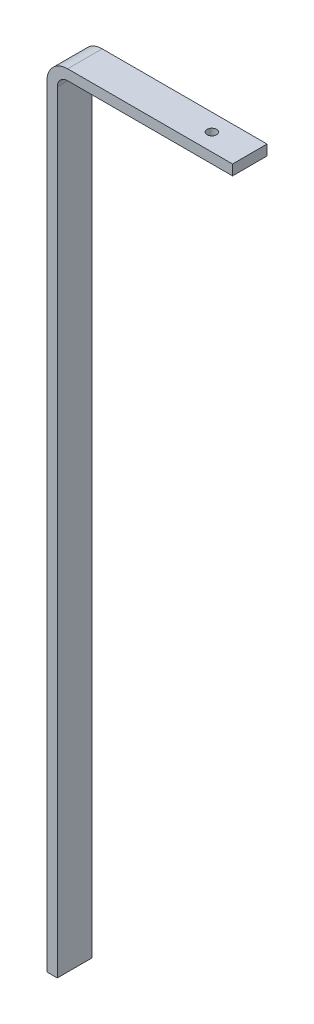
ISO-10303-21;
HEADER;
FILE_DESCRIPTION(('STEP AP214'),'2;1');
FILE_NAME('part.step','',(''),(''),'','','');
FILE_SCHEMA(('AUTOMOTIVE_DESIGN { 1 0 10303 214 1 1 1 1 }'));
ENDSEC;
DATA;
#1=APPLICATION_CONTEXT('core data for automotive mechanical design processes');
#2=APPLICATION_PROTOCOL_DEFINITION('international standard','automotive_design',2000,#1);
#3=PRODUCT_CONTEXT('',#1,'mechanical');
#4=PRODUCT('Part','Part','',(#3));
#5=PRODUCT_RELATED_PRODUCT_CATEGORY('part','',(#4));
#6=PRODUCT_DEFINITION_FORMATION('','',#4);
#7=PRODUCT_DEFINITION_CONTEXT('part definition',#1,'design');
#8=PRODUCT_DEFINITION('design','',#6,#7);
#9=PRODUCT_DEFINITION_SHAPE('','',#8);
#10=(LENGTH_UNIT() NAMED_UNIT(*) SI_UNIT(.MILLI.,.METRE.));
#11=(NAMED_UNIT(*) PLANE_ANGLE_UNIT() SI_UNIT($,.RADIAN.));
#12=(NAMED_UNIT(*) SI_UNIT($,.STERADIAN.) SOLID_ANGLE_UNIT());
#13=UNCERTAINTY_MEASURE_WITH_UNIT(LENGTH_MEASURE(1.E-05),#10,'distance_accuracy_value','');
#14=(GEOMETRIC_REPRESENTATION_CONTEXT(3) GLOBAL_UNCERTAINTY_ASSIGNED_CONTEXT((#13)) GLOBAL_UNIT_ASSIGNED_CONTEXT((#10,
#11,#12)) REPRESENTATION_CONTEXT('',''));
#15=CARTESIAN_POINT('',(0.,0.,0.));
#16=DIRECTION('',(0.,0.,1.));
#17=DIRECTION('',(1.,0.,0.));
#18=AXIS2_PLACEMENT_3D('',#15,#16,#17);
#19=CARTESIAN_POINT('',(95.5,12.,20.));
#20=DIRECTION('',(-1.,0.,0.));
#21=DIRECTION('',(0.,0.,1.));
#22=AXIS2_PLACEMENT_3D('',#19,#20,#21);
#23=PLANE('',#22);
#24=DIRECTION('',(0.,1.,0.));
#25=VECTOR('',#24,1.);
#26=CARTESIAN_POINT('',(95.5,12.,0.));
#27=LINE('',#26,#25);
#28=CARTESIAN_POINT('',(95.5,6.,0.));
#29=VERTEX_POINT('',#28);
#30=CARTESIAN_POINT('',(95.5,12.,0.));
#31=VERTEX_POINT('',#30);
#32=EDGE_CURVE('E127',#29,#31,#27,.T.);
#33=ORIENTED_EDGE('',*,*,#32,.T.);
#34=DIRECTION('',(0.,0.,-1.));
#35=VECTOR('',#34,1.);
#36=CARTESIAN_POINT('',(95.5,12.,20.));
#37=LINE('',#36,#35);
#38=CARTESIAN_POINT('',(95.5,12.,20.));
#39=VERTEX_POINT('',#38);
#40=EDGE_CURVE('E11',#39,#31,#37,.T.);
#41=ORIENTED_EDGE('',*,*,#40,.F.);
#42=DIRECTION('',(0.,1.,0.));
#43=VECTOR('',#42,1.);
#44=CARTESIAN_POINT('',(95.5,12.,20.));
#45=LINE('',#44,#43);
#46=CARTESIAN_POINT('',(95.5,6.,20.));
#47=VERTEX_POINT('',#46);
#48=EDGE_CURVE('E142',#47,#39,#45,.T.);
#49=ORIENTED_EDGE('',*,*,#48,.F.);
#50=DIRECTION('',(0.,0.,-1.));
#51=VECTOR('',#50,1.);
#52=CARTESIAN_POINT('',(95.5,6.,20.));
#53=LINE('',#52,#51);
#54=EDGE_CURVE('E123',#47,#29,#53,.T.);
#55=ORIENTED_EDGE('',*,*,#54,.T.);
#56=EDGE_LOOP('',(#33,#41,#49,#55));
#57=FACE_BOUND('',#56,.T.);
#58=ADVANCED_FACE('F31',(#57),#23,.F.);
#59=CARTESIAN_POINT('',(95.5,12.,20.));
#60=DIRECTION('',(0.,-1.,0.));
#61=DIRECTION('',(1.,0.,0.));
#62=AXIS2_PLACEMENT_3D('',#59,#60,#61);
#63=PLANE('',#62);
#64=CARTESIAN_POINT('',(73.5,12.,10.));
#65=DIRECTION('',(0.,1.,0.));
#66=DIRECTION('',(0.,0.,1.));
#67=AXIS2_PLACEMENT_3D('',#64,#65,#66);
#68=CIRCLE('',#67,2.74999999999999);
#69=CARTESIAN_POINT('',(73.5,12.,12.75));
#70=VERTEX_POINT('',#69);
#71=EDGE_CURVE('E177',#70,#70,#68,.T.);
#72=ORIENTED_EDGE('',*,*,#71,.F.);
#73=EDGE_LOOP('',(#72));
#74=FACE_BOUND('',#73,.T.);
#75=DIRECTION('',(-1.,0.,0.));
#76=VECTOR('',#75,1.);
#77=CARTESIAN_POINT('',(95.5,12.,0.));
#78=LINE('',#77,#76);
#79=CARTESIAN_POINT('',(0.,12.,0.));
#80=VERTEX_POINT('',#79);
#81=EDGE_CURVE('E130',#31,#80,#78,.T.);
#82=ORIENTED_EDGE('',*,*,#81,.T.);
#83=DIRECTION('',(0.,0.,-1.));
#84=VECTOR('',#83,1.);
#85=CARTESIAN_POINT('',(0.,12.,20.));
#86=LINE('',#85,#84);
#87=CARTESIAN_POINT('',(0.,12.,20.));
#88=VERTEX_POINT('',#87);
#89=EDGE_CURVE('E39',#88,#80,#86,.T.);
#90=ORIENTED_EDGE('',*,*,#89,.F.);
#91=DIRECTION('',(-1.,0.,0.));
#92=VECTOR('',#91,1.);
#93=CARTESIAN_POINT('',(95.5,12.,20.));
#94=LINE('',#93,#92);
#95=EDGE_CURVE('E90',#39,#88,#94,.T.);
#96=ORIENTED_EDGE('',*,*,#95,.F.);
#97=ORIENTED_EDGE('',*,*,#40,.T.);
#98=EDGE_LOOP('',(#82,#90,#96,#97));
#99=FACE_BOUND('',#98,.T.);
#100=ADVANCED_FACE('F184',(#74,#99),#63,.F.);
#101=CARTESIAN_POINT('',(0.,0.,20.));
#102=DIRECTION('',(0.,0.,-1.));
#103=DIRECTION('',(-1.,0.,0.));
#104=AXIS2_PLACEMENT_3D('',#101,#102,#103);
#105=CYLINDRICAL_SURFACE('',#104,12.);
#106=CARTESIAN_POINT('',(0.,0.,0.));
#107=DIRECTION('',(0.,0.,1.));
#108=DIRECTION('',(1.,0.,0.));
#109=AXIS2_PLACEMENT_3D('',#106,#107,#108);
#110=CIRCLE('',#109,12.);
#111=CARTESIAN_POINT('',(-12.,0.,0.));
#112=VERTEX_POINT('',#111);
#113=EDGE_CURVE('E133',#80,#112,#110,.T.);
#114=ORIENTED_EDGE('',*,*,#113,.T.);
#115=DIRECTION('',(0.,0.,-1.));
#116=VECTOR('',#115,1.);
#117=CARTESIAN_POINT('',(-12.,0.,20.));
#118=LINE('',#117,#116);
#119=CARTESIAN_POINT('',(-12.,0.,20.));
#120=VERTEX_POINT('',#119);
#121=EDGE_CURVE('E149',#120,#112,#118,.T.);
#122=ORIENTED_EDGE('',*,*,#121,.F.);
#123=CARTESIAN_POINT('',(0.,0.,20.));
#124=DIRECTION('',(0.,0.,1.));
#125=DIRECTION('',(1.,0.,0.));
#126=AXIS2_PLACEMENT_3D('',#123,#124,#125);
#127=CIRCLE('',#126,12.);
#128=EDGE_CURVE('E157',#88,#120,#127,.T.);
#129=ORIENTED_EDGE('',*,*,#128,.F.);
#130=ORIENTED_EDGE('',*,*,#89,.T.);
#131=EDGE_LOOP('',(#114,#122,#129,#130));
#132=FACE_BOUND('',#131,.T.);
#133=ADVANCED_FACE('F155',(#132),#105,.T.);
#134=CARTESIAN_POINT('',(-12.,0.,20.));
#135=DIRECTION('',(1.,0.,0.));
#136=DIRECTION('',(0.,1.,0.));
#137=AXIS2_PLACEMENT_3D('',#134,#135,#136);
#138=PLANE('',#137);
#139=DIRECTION('',(0.,-1.,0.));
#140=VECTOR('',#139,1.);
#141=CARTESIAN_POINT('',(-12.,0.,0.));
#142=LINE('',#141,#140);
#143=CARTESIAN_POINT('',(-11.9999999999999,-447.,0.));
#144=VERTEX_POINT('',#143);
#145=EDGE_CURVE('E135',#112,#144,#142,.T.);
#146=ORIENTED_EDGE('',*,*,#145,.T.);
#147=DIRECTION('',(0.,0.,-1.));
#148=VECTOR('',#147,1.);
#149=CARTESIAN_POINT('',(-11.9999999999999,-447.,20.));
#150=LINE('',#149,#148);
#151=CARTESIAN_POINT('',(-11.9999999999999,-447.,20.));
#152=VERTEX_POINT('',#151);
#153=EDGE_CURVE('E146',#152,#144,#150,.T.);
#154=ORIENTED_EDGE('',*,*,#153,.F.);
#155=DIRECTION('',(0.,-1.,0.));
#156=VECTOR('',#155,1.);
#157=CARTESIAN_POINT('',(-12.,0.,20.));
#158=LINE('',#157,#156);
#159=EDGE_CURVE('E169',#120,#152,#158,.T.);
#160=ORIENTED_EDGE('',*,*,#159,.F.);
#161=ORIENTED_EDGE('',*,*,#121,.T.);
#162=EDGE_LOOP('',(#146,#154,#160,#161));
#163=FACE_BOUND('',#162,.T.);
#164=ADVANCED_FACE('F165',(#163),#138,.F.);
#165=CARTESIAN_POINT('',(-11.9999999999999,-447.,20.));
#166=DIRECTION('',(0.,1.,0.));
#167=DIRECTION('',(0.,0.,1.));
#168=AXIS2_PLACEMENT_3D('',#165,#166,#167);
#169=PLANE('',#168);
#170=DIRECTION('',(1.,0.,0.));
#171=VECTOR('',#170,1.);
#172=CARTESIAN_POINT('',(-11.9999999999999,-447.,0.));
#173=LINE('',#172,#171);
#174=CARTESIAN_POINT('',(-5.99999999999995,-447.,0.));
#175=VERTEX_POINT('',#174);
#176=EDGE_CURVE('E137',#144,#175,#173,.T.);
#177=ORIENTED_EDGE('',*,*,#176,.T.);
#178=DIRECTION('',(0.,0.,-1.));
#179=VECTOR('',#178,1.);
#180=CARTESIAN_POINT('',(-5.99999999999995,-447.,20.));
#181=LINE('',#180,#179);
#182=CARTESIAN_POINT('',(-5.99999999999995,-447.,20.));
#183=VERTEX_POINT('',#182);
#184=EDGE_CURVE('E118',#183,#175,#181,.T.);
#185=ORIENTED_EDGE('',*,*,#184,.F.);
#186=DIRECTION('',(1.,0.,0.));
#187=VECTOR('',#186,1.);
#188=CARTESIAN_POINT('',(-11.9999999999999,-447.,20.));
#189=LINE('',#188,#187);
#190=EDGE_CURVE('E109',#152,#183,#189,.T.);
#191=ORIENTED_EDGE('',*,*,#190,.F.);
#192=ORIENTED_EDGE('',*,*,#153,.T.);
#193=EDGE_LOOP('',(#177,#185,#191,#192));
#194=FACE_BOUND('',#193,.T.);
#195=ADVANCED_FACE('F168',(#194),#169,.F.);
#196=CARTESIAN_POINT('',(-5.99999999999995,-447.,20.));
#197=DIRECTION('',(-1.,0.,0.));
#198=DIRECTION('',(0.,-1.,0.));
#199=AXIS2_PLACEMENT_3D('',#196,#197,#198);
#200=PLANE('',#199);
#201=DIRECTION('',(0.,1.,0.));
#202=VECTOR('',#201,1.);
#203=CARTESIAN_POINT('',(-5.99999999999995,-447.,0.));
#204=LINE('',#203,#202);
#205=CARTESIAN_POINT('',(-6.00000000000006,0.,0.));
#206=VERTEX_POINT('',#205);
#207=EDGE_CURVE('E117',#175,#206,#204,.T.);
#208=ORIENTED_EDGE('',*,*,#207,.T.);
#209=DIRECTION('',(0.,0.,-1.));
#210=VECTOR('',#209,1.);
#211=CARTESIAN_POINT('',(-6.00000000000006,0.,20.));
#212=LINE('',#211,#210);
#213=CARTESIAN_POINT('',(-6.00000000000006,0.,20.));
#214=VERTEX_POINT('',#213);
#215=EDGE_CURVE('E114',#214,#206,#212,.T.);
#216=ORIENTED_EDGE('',*,*,#215,.F.);
#217=DIRECTION('',(0.,1.,0.));
#218=VECTOR('',#217,1.);
#219=CARTESIAN_POINT('',(-5.99999999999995,-447.,20.));
#220=LINE('',#219,#218);
#221=EDGE_CURVE('E103',#183,#214,#220,.T.);
#222=ORIENTED_EDGE('',*,*,#221,.F.);
#223=ORIENTED_EDGE('',*,*,#184,.T.);
#224=EDGE_LOOP('',(#208,#216,#222,#223));
#225=FACE_BOUND('',#224,.T.);
#226=ADVANCED_FACE('F115',(#225),#200,.F.);
#227=CARTESIAN_POINT('',(0.,0.,20.));
#228=DIRECTION('',(0.,0.,-1.));
#229=DIRECTION('',(-1.,0.,0.));
#230=AXIS2_PLACEMENT_3D('',#227,#228,#229);
#231=CYLINDRICAL_SURFACE('',#230,6.);
#232=CARTESIAN_POINT('',(0.,0.,0.));
#233=DIRECTION('',(0.,0.,-1.));
#234=DIRECTION('',(-1.,0.,0.));
#235=AXIS2_PLACEMENT_3D('',#232,#233,#234);
#236=CIRCLE('',#235,6.);
#237=CARTESIAN_POINT('',(0.,6.,0.));
#238=VERTEX_POINT('',#237);
#239=EDGE_CURVE('E76',#206,#238,#236,.T.);
#240=ORIENTED_EDGE('',*,*,#239,.T.);
#241=DIRECTION('',(0.,0.,-1.));
#242=VECTOR('',#241,1.);
#243=CARTESIAN_POINT('',(0.,6.,20.));
#244=LINE('',#243,#242);
#245=CARTESIAN_POINT('',(0.,6.,20.));
#246=VERTEX_POINT('',#245);
#247=EDGE_CURVE('E119',#246,#238,#244,.T.);
#248=ORIENTED_EDGE('',*,*,#247,.F.);
#249=CARTESIAN_POINT('',(0.,0.,20.));
#250=DIRECTION('',(0.,0.,-1.));
#251=DIRECTION('',(-1.,0.,0.));
#252=AXIS2_PLACEMENT_3D('',#249,#250,#251);
#253=CIRCLE('',#252,6.);
#254=EDGE_CURVE('E107',#214,#246,#253,.T.);
#255=ORIENTED_EDGE('',*,*,#254,.F.);
#256=ORIENTED_EDGE('',*,*,#215,.T.);
#257=EDGE_LOOP('',(#240,#248,#255,#256));
#258=FACE_BOUND('',#257,.T.);
#259=ADVANCED_FACE('F121',(#258),#231,.F.);
#260=CARTESIAN_POINT('',(0.,6.00000000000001,20.));
#261=DIRECTION('',(0.,1.,0.));
#262=DIRECTION('',(-1.,0.,0.));
#263=AXIS2_PLACEMENT_3D('',#260,#261,#262);
#264=PLANE('',#263);
#265=CARTESIAN_POINT('',(73.5,6.,10.));
#266=DIRECTION('',(0.,1.,0.));
#267=DIRECTION('',(-1.,0.,0.));
#268=AXIS2_PLACEMENT_3D('',#265,#266,#267);
#269=CIRCLE('',#268,2.74999999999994);
#270=CARTESIAN_POINT('',(70.7500000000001,6.,10.));
#271=VERTEX_POINT('',#270);
#272=EDGE_CURVE('E131',#271,#271,#269,.T.);
#273=ORIENTED_EDGE('',*,*,#272,.T.);
#274=EDGE_LOOP('',(#273));
#275=FACE_BOUND('',#274,.T.);
#276=DIRECTION('',(1.,0.,0.));
#277=VECTOR('',#276,1.);
#278=CARTESIAN_POINT('',(0.,6.00000000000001,0.));
#279=LINE('',#278,#277);
#280=EDGE_CURVE('E82',#238,#29,#279,.T.);
#281=ORIENTED_EDGE('',*,*,#280,.T.);
#282=ORIENTED_EDGE('',*,*,#54,.F.);
#283=DIRECTION('',(1.,0.,0.));
#284=VECTOR('',#283,1.);
#285=CARTESIAN_POINT('',(0.,6.00000000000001,20.));
#286=LINE('',#285,#284);
#287=EDGE_CURVE('E47',#246,#47,#286,.T.);
#288=ORIENTED_EDGE('',*,*,#287,.F.);
#289=ORIENTED_EDGE('',*,*,#247,.T.);
#290=EDGE_LOOP('',(#281,#282,#288,#289));
#291=FACE_BOUND('',#290,.T.);
#292=ADVANCED_FACE('F189',(#275,#291),#264,.F.);
#293=CARTESIAN_POINT('',(0.,0.,20.));
#294=DIRECTION('',(0.,0.,-1.));
#295=DIRECTION('',(-1.,0.,0.));
#296=AXIS2_PLACEMENT_3D('',#293,#294,#295);
#297=PLANE('',#296);
#298=ORIENTED_EDGE('',*,*,#48,.T.);
#299=ORIENTED_EDGE('',*,*,#95,.T.);
#300=ORIENTED_EDGE('',*,*,#128,.T.);
#301=ORIENTED_EDGE('',*,*,#159,.T.);
#302=ORIENTED_EDGE('',*,*,#190,.T.);
#303=ORIENTED_EDGE('',*,*,#221,.T.);
#304=ORIENTED_EDGE('',*,*,#254,.T.);
#305=ORIENTED_EDGE('',*,*,#287,.T.);
#306=EDGE_LOOP('',(#298,#299,#300,#301,#302,#303,#304,#305));
#307=FACE_BOUND('',#306,.T.);
#308=ADVANCED_FACE('F105',(#307),#297,.F.);
#309=CARTESIAN_POINT('',(0.,0.,0.));
#310=DIRECTION('',(0.,0.,-1.));
#311=DIRECTION('',(-1.,0.,0.));
#312=AXIS2_PLACEMENT_3D('',#309,#310,#311);
#313=PLANE('',#312);
#314=ORIENTED_EDGE('',*,*,#32,.F.);
#315=ORIENTED_EDGE('',*,*,#280,.F.);
#316=ORIENTED_EDGE('',*,*,#239,.F.);
#317=ORIENTED_EDGE('',*,*,#207,.F.);
#318=ORIENTED_EDGE('',*,*,#176,.F.);
#319=ORIENTED_EDGE('',*,*,#145,.F.);
#320=ORIENTED_EDGE('',*,*,#113,.F.);
#321=ORIENTED_EDGE('',*,*,#81,.F.);
#322=EDGE_LOOP('',(#314,#315,#316,#317,#318,#319,#320,#321));
#323=FACE_BOUND('',#322,.T.);
#324=ADVANCED_FACE('F161',(#323),#313,.T.);
#325=CARTESIAN_POINT('',(73.5,12.,10.));
#326=DIRECTION('',(0.,1.,0.));
#327=DIRECTION('',(0.,0.,1.));
#328=AXIS2_PLACEMENT_3D('',#325,#326,#327);
#329=CYLINDRICAL_SURFACE('',#328,2.74999999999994);
#330=ORIENTED_EDGE('',*,*,#71,.T.);
#331=EDGE_LOOP('',(#330));
#332=FACE_BOUND('',#331,.T.);
#333=ORIENTED_EDGE('',*,*,#272,.F.);
#334=EDGE_LOOP('',(#333));
#335=FACE_BOUND('',#334,.T.);
#336=ADVANCED_FACE('F181',(#332,#335),#329,.F.);
#337=CLOSED_SHELL('',(#58,#100,#133,#164,#195,#226,#259,#292,#308,#324,#336));
#338=MANIFOLD_SOLID_BREP('B2',#337);
#339=ADVANCED_BREP_SHAPE_REPRESENTATION('',(#18,#338),#14);
#340=SHAPE_DEFINITION_REPRESENTATION(#9,#339);
ENDSEC;
END-ISO-10303-21;
